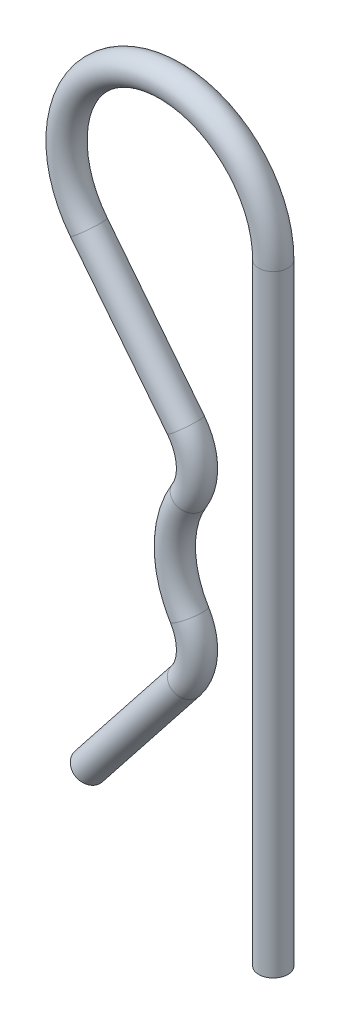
from build123d import *

# Parameters (mm, degrees)
ESQUISSE2_R = 1.2


with BuildPart() as part:
    # Base-Balayage: sweep along a path in Esquisse4
    with BuildLine(Plane.XY) as base_balayage_path:
        Line((0, -25.834514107), (0, 24.465485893))
        ThreePointArc((0, 24.465485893), (-11.28957529, 32.494699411), (-15.169004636, 19.195345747))
        Line((-15.169004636, 19.195345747), (-7.189518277, 9.09784738))
        ThreePointArc((-7.189518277, 9.09784738), (-6.281420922, 6.713472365), (-6.902394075, 4.23874463))
        ThreePointArc((-6.902394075, 4.23874463), (-8.1, 0), (-6.902394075, -4.23874463))
        ThreePointArc((-6.902394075, -4.23874463), (-6.281420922, -6.713472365), (-7.189518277, -9.09784738))
        Line((-7.189518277, -9.09784738), (-15.169004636, -19.195345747))
    # Esquisse2 → Base-Balayage (sweep)
    with BuildSketch(Plane(origin=(0, -25.834514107, 0), x_dir=(1, 0, 0), z_dir=(0, 1, 0))):
        Circle(ESQUISSE2_R)
    sweep(path=base_balayage_path.line)


solid = part.part
